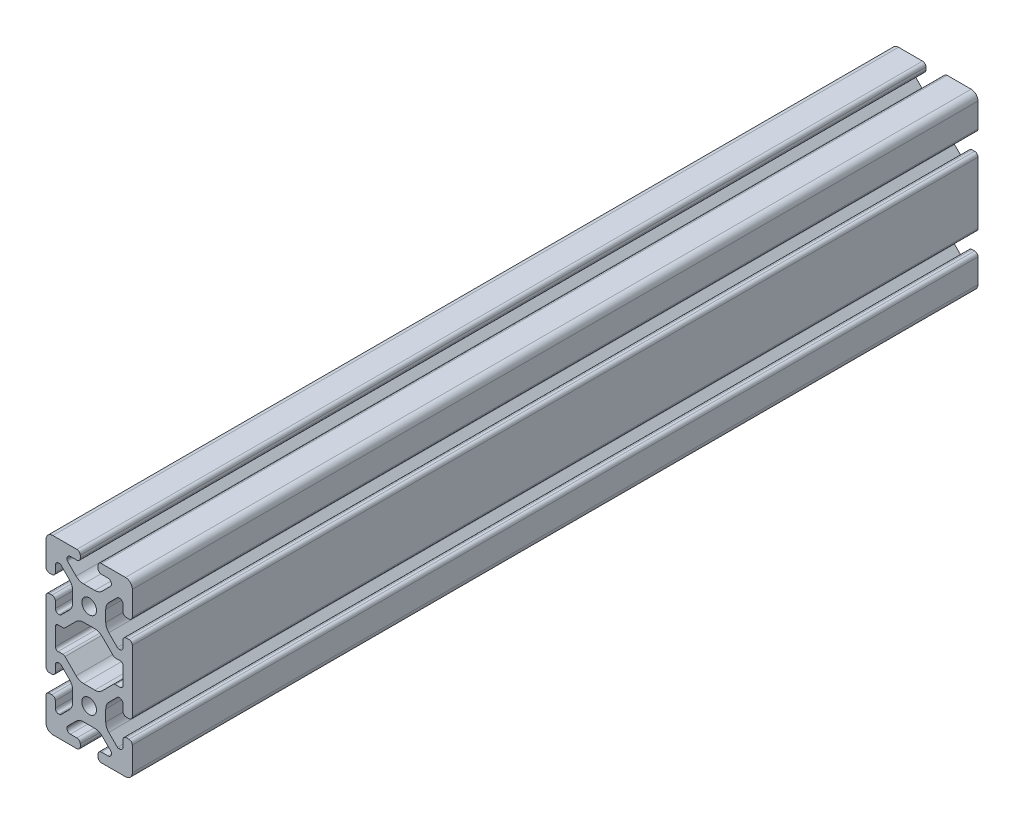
from build123d import *

# Parameters (mm, degrees)
SKETCH1_R           = 3.405
BOSS_EXTRUDE1_DEPTH = 3048
SKETCH26_W          = 40
SKETCH26_H          = 80.80011746
CUT_EXTRUDE1_DEPTH  = 2287.874723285
SKETCH33_W          = 40
SKETCH33_H          = 80.80011746
CUT_EXTRUDE2_DEPTH  = 1526.311771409
SKETCH41_W          = 40
SKETCH41_H          = 80.80011746
CUT_EXTRUDE3_DEPTH  = 1116.83781704
SKETCH50_W          = 40
SKETCH50_H          = 80.80011746
CUT_EXTRUDE4_DEPTH  = 787.391388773
SKETCH51_W          = 40
SKETCH51_H          = 80.80011746
CUT_EXTRUDE5_DEPTH  = 397.992259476


with BuildPart() as part:
    # Sketch1 → Boss-Extrude1 (new body)
    with BuildSketch(Plane(origin=(0, 0, -3048), x_dir=(-1, 0, 0), z_dir=(0, 0, -1))):
        with BuildLine():
            Line((16.83, 60), (5.69044933, 60))
            ThreePointArc((5.69044933, 60), (4.580291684, 59.540157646), (4.12044933, 58.43))
            Line((4.12044933, 58.43), (4.12044933, 57.25))
            ThreePointArc((4.12044933, 57.25), (4.580291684, 56.139842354), (5.69044933, 55.68))
            Line((5.69044933, 55.68), (8.7153995, 55.68))
            ThreePointArc((8.7153995, 55.68), (9.825557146, 55.220157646), (10.2853995, 54.11))
            Line((10.2853995, 54.11), (10.2853995, 53.654903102))
            ThreePointArc((10.2853995, 53.654903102), (10.227547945, 53.364063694), (10.062800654, 53.117501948))
            Line((10.062800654, 53.117501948), (6.055092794, 49.109794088))
            ThreePointArc((6.055092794, 49.109794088), (4.47691877, 48.055291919), (2.615335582, 47.685))
            Line((2.615335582, 47.685), (-2.615335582, 47.685))
            ThreePointArc((-2.615335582, 47.685), (-4.47691877, 48.055291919), (-6.055092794, 49.109794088))
            Line((-6.055092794, 49.109794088), (-10.062800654, 53.117501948))
            ThreePointArc((-10.062800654, 53.117501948), (-10.227547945, 53.364063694), (-10.2853995, 53.654903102))
            Line((-10.2853995, 53.654903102), (-10.2853995, 54.11))
            ThreePointArc((-10.2853995, 54.11), (-9.825557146, 55.220157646), (-8.7153995, 55.68))
            Line((-8.7153995, 55.68), (-5.69044933, 55.68))
            ThreePointArc((-5.69044933, 55.68), (-4.580291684, 56.139842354), (-4.12044933, 57.25))
            Line((-4.12044933, 57.25), (-4.12044933, 58.43))
            ThreePointArc((-4.12044933, 58.43), (-4.580291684, 59.540157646), (-5.69044933, 60))
            Line((-5.69044933, 60), (-16.83, 60))
            ThreePointArc((-16.83, 60), (-19.071528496, 59.071528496), (-20, 56.83))
            Line((-20, 56.83), (-20, 45.69044933))
            ThreePointArc((-20, 45.69044933), (-19.540157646, 44.580291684), (-18.43, 44.12044933))
            Line((-18.43, 44.12044933), (-17.25, 44.12044933))
            ThreePointArc((-17.25, 44.12044933), (-16.139842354, 44.580291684), (-15.68, 45.69044933))
            Line((-15.68, 45.69044933), (-15.68, 48.7153995))
            ThreePointArc((-15.68, 48.7153995), (-15.220157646, 49.825557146), (-14.11, 50.2853995))
            Line((-14.11, 50.2853995), (-13.652670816, 50.2853995))
            ThreePointArc((-13.652670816, 50.2853995), (-13.361831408, 50.227547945), (-13.115269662, 50.062800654))
            Line((-13.115269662, 50.062800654), (-9.109794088, 46.05732508))
            ThreePointArc((-9.109794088, 46.05732508), (-8.055291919, 44.479151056), (-7.685, 42.617567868))
            Line((-7.685, 42.617567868), (-7.685, 37.384664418))
            ThreePointArc((-7.685, 37.384664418), (-8.055291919, 35.52308123), (-9.109794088, 33.944907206))
            Line((-9.109794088, 33.944907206), (-13.117501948, 29.937199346))
            ThreePointArc((-13.117501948, 29.937199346), (-13.364063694, 29.772452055), (-13.654903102, 29.7146005))
            Line((-13.654903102, 29.7146005), (-14.11, 29.7146005))
            ThreePointArc((-14.11, 29.7146005), (-15.220157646, 30.174442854), (-15.68, 31.2846005))
            Line((-15.68, 31.2846005), (-15.68, 34.30955067))
            ThreePointArc((-15.68, 34.30955067), (-16.139842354, 35.419708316), (-17.25, 35.87955067))
            Line((-17.25, 35.87955067), (-18.43, 35.87955067))
            ThreePointArc((-18.43, 35.87955067), (-19.540157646, 35.419708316), (-20, 34.30955067))
            Line((-20, 34.30955067), (-20, 5.69044933))
            ThreePointArc((-20, 5.69044933), (-19.540157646, 4.580291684), (-18.43, 4.12044933))
            Line((-18.43, 4.12044933), (-17.25, 4.12044933))
            ThreePointArc((-17.25, 4.12044933), (-16.139842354, 4.580291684), (-15.68, 5.69044933))
            Line((-15.68, 5.69044933), (-15.68, 8.7153995))
            ThreePointArc((-15.68, 8.7153995), (-15.220157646, 9.825557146), (-14.11, 10.2853995))
            Line((-14.11, 10.2853995), (-13.654903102, 10.2853995))
            ThreePointArc((-13.654903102, 10.2853995), (-13.364063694, 10.227547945), (-13.117501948, 10.062800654))
            Line((-13.117501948, 10.062800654), (-9.109794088, 6.055092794))
            ThreePointArc((-9.109794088, 6.055092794), (-8.055291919, 4.47691877), (-7.685, 2.615335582))
            Line((-7.685, 2.615335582), (-7.685, -2.615335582))
            ThreePointArc((-7.685, -2.615335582), (-8.055291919, -4.47691877), (-9.109794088, -6.055092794))
            Line((-9.109794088, -6.055092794), (-13.117501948, -10.062800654))
            ThreePointArc((-13.117501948, -10.062800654), (-13.364063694, -10.227547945), (-13.654903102, -10.2853995))
            Line((-13.654903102, -10.2853995), (-14.11, -10.2853995))
            ThreePointArc((-14.11, -10.2853995), (-15.220157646, -9.825557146), (-15.68, -8.7153995))
            Line((-15.68, -8.7153995), (-15.68, -5.69044933))
            ThreePointArc((-15.68, -5.69044933), (-16.139842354, -4.580291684), (-17.25, -4.12044933))
            Line((-17.25, -4.12044933), (-18.43, -4.12044933))
            ThreePointArc((-18.43, -4.12044933), (-19.540157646, -4.580291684), (-20, -5.69044933))
            Line((-20, -5.69044933), (-20, -16.83))
            ThreePointArc((-20, -16.83), (-19.071528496, -19.071528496), (-16.83, -20))
            Line((-16.83, -20), (-5.69044933, -20))
            ThreePointArc((-5.69044933, -20), (-4.580291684, -19.540157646), (-4.12044933, -18.43))
            Line((-4.12044933, -18.43), (-4.12044933, -17.25))
            ThreePointArc((-4.12044933, -17.25), (-4.580291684, -16.139842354), (-5.69044933, -15.68))
            Line((-5.69044933, -15.68), (-8.7153995, -15.68))
            ThreePointArc((-8.7153995, -15.68), (-9.825557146, -15.220157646), (-10.2853995, -14.11))
            Line((-10.2853995, -14.11), (-10.2853995, -13.654903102))
            ThreePointArc((-10.2853995, -13.654903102), (-10.227547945, -13.364063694), (-10.062800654, -13.117501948))
            Line((-10.062800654, -13.117501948), (-6.055092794, -9.109794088))
            ThreePointArc((-6.055092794, -9.109794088), (-4.47691877, -8.055291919), (-2.615335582, -7.685))
            Line((-2.615335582, -7.685), (2.615335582, -7.685))
            ThreePointArc((2.615335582, -7.685), (4.47691877, -8.055291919), (6.055092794, -9.109794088))
            Line((6.055092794, -9.109794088), (10.062800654, -13.117501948))
            ThreePointArc((10.062800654, -13.117501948), (10.227547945, -13.364063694), (10.2853995, -13.654903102))
            Line((10.2853995, -13.654903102), (10.2853995, -14.11))
            ThreePointArc((10.2853995, -14.11), (9.825557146, -15.220157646), (8.7153995, -15.68))
            Line((8.7153995, -15.68), (5.69044933, -15.68))
            ThreePointArc((5.69044933, -15.68), (4.580291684, -16.139842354), (4.12044933, -17.25))
            Line((4.12044933, -17.25), (4.12044933, -18.43))
            ThreePointArc((4.12044933, -18.43), (4.580291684, -19.540157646), (5.69044933, -20))
            Line((5.69044933, -20), (16.83, -20))
            ThreePointArc((16.83, -20), (19.071528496, -19.071528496), (20, -16.83))
            Line((20, -16.83), (20, -5.69044933))
            ThreePointArc((20, -5.69044933), (19.540157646, -4.580291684), (18.43, -4.12044933))
            Line((18.43, -4.12044933), (17.25, -4.12044933))
            ThreePointArc((17.25, -4.12044933), (16.139842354, -4.580291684), (15.68, -5.69044933))
            Line((15.68, -5.69044933), (15.68, -8.7153995))
            ThreePointArc((15.68, -8.7153995), (15.220157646, -9.825557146), (14.11, -10.2853995))
            Line((14.11, -10.2853995), (13.654903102, -10.2853995))
            ThreePointArc((13.654903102, -10.2853995), (13.364063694, -10.227547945), (13.117501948, -10.062800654))
            Line((13.117501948, -10.062800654), (9.109794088, -6.055092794))
            ThreePointArc((9.109794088, -6.055092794), (8.055291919, -4.47691877), (7.685, -2.615335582))
            Line((7.685, -2.615335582), (7.685, 2.615335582))
            ThreePointArc((7.685, 2.615335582), (8.055291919, 4.47691877), (9.109794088, 6.055092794))
            Line((9.109794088, 6.055092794), (13.117501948, 10.062800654))
            ThreePointArc((13.117501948, 10.062800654), (13.364063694, 10.227547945), (13.654903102, 10.2853995))
            Line((13.654903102, 10.2853995), (14.11, 10.2853995))
            ThreePointArc((14.11, 10.2853995), (15.220157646, 9.825557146), (15.68, 8.7153995))
            Line((15.68, 8.7153995), (15.68, 5.69044933))
            ThreePointArc((15.68, 5.69044933), (16.139842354, 4.580291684), (17.25, 4.12044933))
            Line((17.25, 4.12044933), (18.43, 4.12044933))
            ThreePointArc((18.43, 4.12044933), (19.540157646, 4.580291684), (20, 5.69044933))
            Line((20, 5.69044933), (20, 34.30955067))
            ThreePointArc((20, 34.30955067), (19.540157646, 35.419708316), (18.43, 35.87955067))
            Line((18.43, 35.87955067), (17.25, 35.87955067))
            ThreePointArc((17.25, 35.87955067), (16.139842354, 35.419708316), (15.68, 34.30955067))
            Line((15.68, 34.30955067), (15.68, 31.2846005))
            ThreePointArc((15.68, 31.2846005), (15.220157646, 30.174442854), (14.11, 29.7146005))
            Line((14.11, 29.7146005), (13.654903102, 29.7146005))
            ThreePointArc((13.654903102, 29.7146005), (13.364063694, 29.772452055), (13.117501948, 29.937199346))
            Line((13.117501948, 29.937199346), (9.109794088, 33.944907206))
            ThreePointArc((9.109794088, 33.944907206), (8.055291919, 35.52308123), (7.685, 37.384664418))
            Line((7.685, 37.384664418), (7.685, 42.615335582))
            ThreePointArc((7.685, 42.615335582), (8.055291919, 44.47691877), (9.109794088, 46.055092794))
            Line((9.109794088, 46.055092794), (13.117501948, 50.062800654))
            ThreePointArc((13.117501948, 50.062800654), (13.364063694, 50.227547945), (13.654903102, 50.2853995))
            Line((13.654903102, 50.2853995), (14.11, 50.2853995))
            ThreePointArc((14.11, 50.2853995), (15.220157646, 49.825557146), (15.68, 48.7153995))
            Line((15.68, 48.7153995), (15.68, 45.69044933))
            ThreePointArc((15.68, 45.69044933), (16.139842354, 44.580291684), (17.25, 44.12044933))
            Line((17.25, 44.12044933), (18.43, 44.12044933))
            ThreePointArc((18.43, 44.12044933), (19.540157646, 44.580291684), (20, 45.69044933))
            Line((20, 45.69044933), (20, 56.83))
            ThreePointArc((20, 56.83), (19.071528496, 59.071528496), (16.83, 60))
        make_face()
        with Locations(Location((0, 0, 0), (0, 0, 180))):
            Circle(SKETCH1_R, mode=Mode.SUBTRACT)
        with Locations(Location((0, 40, 0), (0, 0, 180))):
            Circle(SKETCH1_R, mode=Mode.SUBTRACT)
        with BuildLine():
            Line((14.41, 14.65864833), (12.129998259, 14.65864833))
            ThreePointArc((12.129998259, 14.65864833), (11.608780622, 14.546764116), (11.179399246, 14.230824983))
            Line((11.179399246, 14.230824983), (6.055092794, 9.109794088))
            ThreePointArc((6.055092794, 9.109794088), (4.47691877, 8.055291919), (2.615335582, 7.685))
            Line((2.615335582, 7.685), (-2.615335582, 7.685))
            ThreePointArc((-2.615335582, 7.685), (-4.47691877, 8.055291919), (-6.055092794, 9.109794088))
            Line((-6.055092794, 9.109794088), (-11.231972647, 14.286673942))
            ThreePointArc((-11.231972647, 14.286673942), (-11.6439903, 14.561975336), (-12.129998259, 14.65864833))
            Line((-12.129998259, 14.65864833), (-14.41, 14.65864833))
            ThreePointArc((-14.41, 14.65864833), (-15.308025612, 15.030622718), (-15.68, 15.92864833))
            Line((-15.68, 15.92864833), (-15.68, 24.07135167))
            ThreePointArc((-15.68, 24.07135167), (-15.308025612, 24.969377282), (-14.41, 25.34135167))
            Line((-14.41, 25.34135167), (-12.129998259, 25.34135167))
            ThreePointArc((-12.129998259, 25.34135167), (-11.6439903, 25.438024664), (-11.231972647, 25.713326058))
            Line((-11.231972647, 25.713326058), (-6.055092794, 30.890205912))
            ThreePointArc((-6.055092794, 30.890205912), (-4.47691877, 31.944708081), (-2.615335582, 32.315))
            Line((-2.615335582, 32.315), (2.617567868, 32.315))
            ThreePointArc((2.617567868, 32.315), (4.479151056, 31.944708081), (6.05732508, 30.890205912))
            Line((6.05732508, 30.890205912), (11.184160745, 25.763370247))
            ThreePointArc((11.184160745, 25.763370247), (11.612140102, 25.451641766), (12.129998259, 25.34135167))
            Line((12.129998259, 25.34135167), (14.41, 25.34135167))
            ThreePointArc((14.41, 25.34135167), (15.308025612, 24.969377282), (15.68, 24.07135167))
            Line((15.68, 24.07135167), (15.68, 15.92864833))
            ThreePointArc((15.68, 15.92864833), (15.308025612, 15.030622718), (14.41, 14.65864833))
        make_face(mode=Mode.SUBTRACT)
    extrude(amount=-BOSS_EXTRUDE1_DEPTH)

    # Sketch26 → Cut-Extrude1 (cut, through all)
    with BuildSketch(Plane.XY.offset(-762)):
        with Locations((0, 19.59994127)):
            Rectangle(SKETCH26_W, SKETCH26_H)
    extrude(amount=CUT_EXTRUDE1_DEPTH, mode=Mode.SUBTRACT)

    # Sketch33 → Cut-Extrude2 (cut, through all)
    with BuildSketch(Plane.XY.offset(-1524)):
        with Locations((0, 19.59994127)):
            Rectangle(SKETCH33_W, SKETCH33_H)
    extrude(amount=CUT_EXTRUDE2_DEPTH, mode=Mode.SUBTRACT)

    # Sketch41 → Cut-Extrude3 (cut, through all)
    with BuildSketch(Plane.XY.offset(-1933.956)):
        with Locations((0, 19.59994127)):
            Rectangle(SKETCH41_W, SKETCH41_H)
    extrude(amount=CUT_EXTRUDE3_DEPTH, mode=Mode.SUBTRACT)

    # Sketch50 → Cut-Extrude4 (cut, through all)
    with BuildSketch(Plane.XY.offset(-2264.156)):
        with Locations((0, 19.59994127)):
            Rectangle(SKETCH50_W, SKETCH50_H)
    extrude(amount=CUT_EXTRUDE4_DEPTH, mode=Mode.SUBTRACT)

    # Sketch51 → Cut-Extrude5 (cut, through all)
    with BuildSketch(Plane.XY.offset(-2656.078)):
        with Locations((0, 19.59994127)):
            Rectangle(SKETCH51_W, SKETCH51_H)
    extrude(amount=CUT_EXTRUDE5_DEPTH, mode=Mode.SUBTRACT)


solid = part.part
